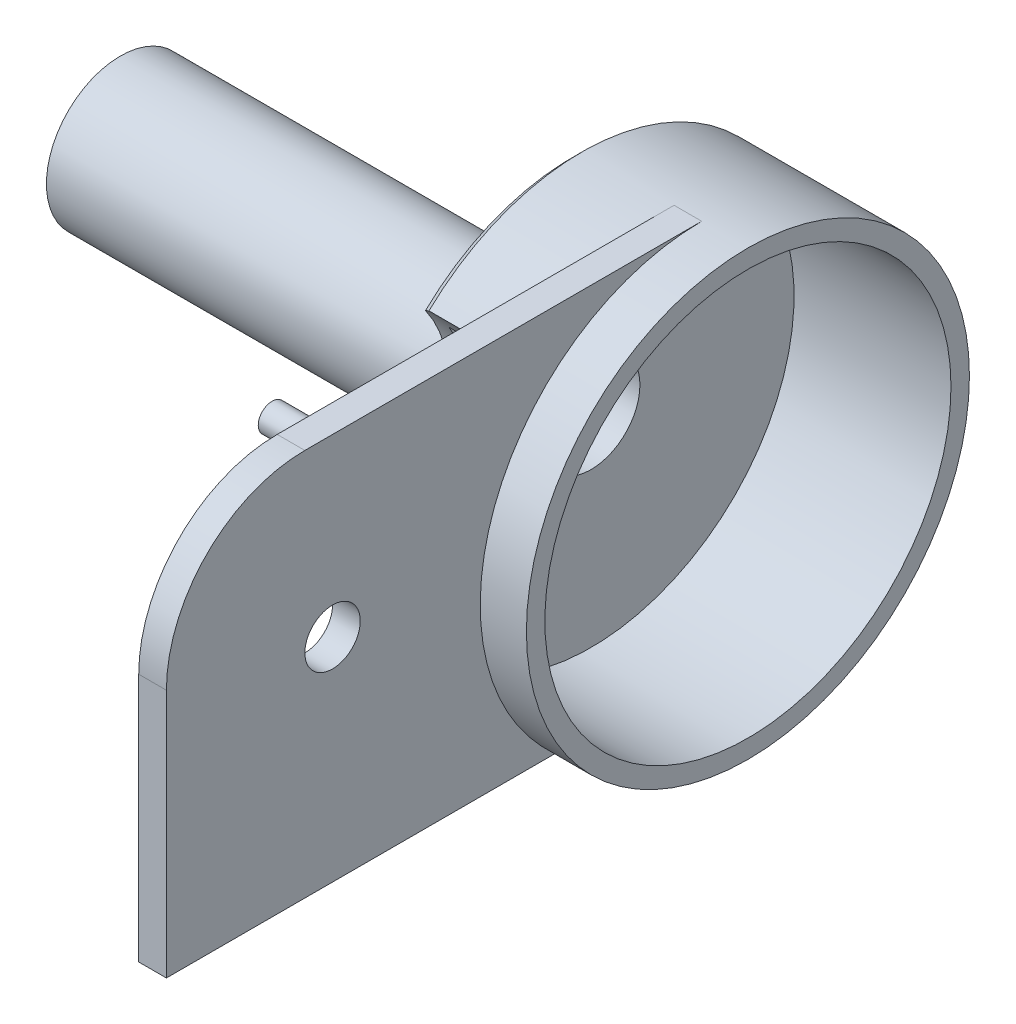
ISO-10303-21;
HEADER;
FILE_DESCRIPTION(('STEP AP214'),'2;1');
FILE_NAME('part.step','',(''),(''),'','','');
FILE_SCHEMA(('AUTOMOTIVE_DESIGN { 1 0 10303 214 1 1 1 1 }'));
ENDSEC;
DATA;
#1=APPLICATION_CONTEXT('core data for automotive mechanical design processes');
#2=APPLICATION_PROTOCOL_DEFINITION('international standard','automotive_design',2000,#1);
#3=PRODUCT_CONTEXT('',#1,'mechanical');
#4=PRODUCT('Part','Part','',(#3));
#5=PRODUCT_RELATED_PRODUCT_CATEGORY('part','',(#4));
#6=PRODUCT_DEFINITION_FORMATION('','',#4);
#7=PRODUCT_DEFINITION_CONTEXT('part definition',#1,'design');
#8=PRODUCT_DEFINITION('design','',#6,#7);
#9=PRODUCT_DEFINITION_SHAPE('','',#8);
#10=(LENGTH_UNIT() NAMED_UNIT(*) SI_UNIT(.MILLI.,.METRE.));
#11=(NAMED_UNIT(*) PLANE_ANGLE_UNIT() SI_UNIT($,.RADIAN.));
#12=(NAMED_UNIT(*) SI_UNIT($,.STERADIAN.) SOLID_ANGLE_UNIT());
#13=UNCERTAINTY_MEASURE_WITH_UNIT(LENGTH_MEASURE(1.E-05),#10,'distance_accuracy_value','');
#14=(GEOMETRIC_REPRESENTATION_CONTEXT(3) GLOBAL_UNCERTAINTY_ASSIGNED_CONTEXT((#13)) GLOBAL_UNIT_ASSIGNED_CONTEXT((#10,
#11,#12)) REPRESENTATION_CONTEXT('',''));
#15=CARTESIAN_POINT('',(0.,0.,0.));
#16=DIRECTION('',(0.,0.,1.));
#17=DIRECTION('',(1.,0.,0.));
#18=AXIS2_PLACEMENT_3D('',#15,#16,#17);
#19=CARTESIAN_POINT('',(0.,0.,0.));
#20=DIRECTION('',(1.,0.,0.));
#21=DIRECTION('',(0.,0.,-1.));
#22=AXIS2_PLACEMENT_3D('',#19,#20,#21);
#23=PLANE('',#22);
#24=CARTESIAN_POINT('',(0.,0.,-300.));
#25=DIRECTION('',(1.,0.,0.));
#26=DIRECTION('',(0.,0.,-1.));
#27=AXIS2_PLACEMENT_3D('',#24,#25,#26);
#28=CIRCLE('',#27,22.);
#29=CARTESIAN_POINT('',(0.,0.,-322.));
#30=VERTEX_POINT('',#29);
#31=EDGE_CURVE('E250',#30,#30,#28,.T.);
#32=ORIENTED_EDGE('',*,*,#31,.F.);
#33=EDGE_LOOP('',(#32));
#34=FACE_BOUND('',#33,.T.);
#35=CARTESIAN_POINT('',(0.,0.,-300.));
#36=DIRECTION('',(1.,0.,0.));
#37=DIRECTION('',(0.,0.,-1.));
#38=AXIS2_PLACEMENT_3D('',#35,#36,#37);
#39=CIRCLE('',#38,24.);
#40=CARTESIAN_POINT('',(0.,0.,-324.));
#41=VERTEX_POINT('',#40);
#42=EDGE_CURVE('E37',#41,#41,#39,.F.);
#43=ORIENTED_EDGE('',*,*,#42,.F.);
#44=EDGE_LOOP('',(#43));
#45=FACE_BOUND('',#44,.T.);
#46=ADVANCED_FACE('F33',(#34,#45),#23,.T.);
#47=CARTESIAN_POINT('',(-66.15,0.,-300.));
#48=DIRECTION('',(-1.,0.,0.));
#49=DIRECTION('',(0.,0.,-1.));
#50=AXIS2_PLACEMENT_3D('',#47,#48,#49);
#51=PLANE('',#50);
#52=CARTESIAN_POINT('',(-66.15,0.,-300.));
#53=DIRECTION('',(1.,0.,0.));
#54=DIRECTION('',(0.,0.,-1.));
#55=AXIS2_PLACEMENT_3D('',#52,#53,#54);
#56=CIRCLE('',#55,6.);
#57=CARTESIAN_POINT('',(-66.15,0.,-306.));
#58=VERTEX_POINT('',#57);
#59=EDGE_CURVE('E301',#58,#58,#56,.T.);
#60=ORIENTED_EDGE('',*,*,#59,.F.);
#61=EDGE_LOOP('',(#60));
#62=FACE_BOUND('',#61,.T.);
#63=CARTESIAN_POINT('',(-66.15,0.,-300.));
#64=DIRECTION('',(1.,0.,0.));
#65=DIRECTION('',(0.,0.,-1.));
#66=AXIS2_PLACEMENT_3D('',#63,#64,#65);
#67=CIRCLE('',#66,6.25);
#68=CARTESIAN_POINT('',(-66.15,0.,-306.25));
#69=VERTEX_POINT('',#68);
#70=EDGE_CURVE('E314',#69,#69,#67,.T.);
#71=ORIENTED_EDGE('',*,*,#70,.T.);
#72=EDGE_LOOP('',(#71));
#73=FACE_BOUND('',#72,.T.);
#74=ADVANCED_FACE('F152',(#62,#73),#51,.F.);
#75=CARTESIAN_POINT('',(-66.15,0.,-300.));
#76=DIRECTION('',(1.,0.,0.));
#77=DIRECTION('',(0.,0.,1.));
#78=AXIS2_PLACEMENT_3D('',#75,#76,#77);
#79=CYLINDRICAL_SURFACE('',#78,6.25);
#80=ORIENTED_EDGE('',*,*,#70,.F.);
#81=EDGE_LOOP('',(#80));
#82=FACE_BOUND('',#81,.T.);
#83=CARTESIAN_POINT('',(-65.,0.,-300.));
#84=DIRECTION('',(1.,0.,0.));
#85=DIRECTION('',(0.,0.,-1.));
#86=AXIS2_PLACEMENT_3D('',#83,#84,#85);
#87=CIRCLE('',#86,6.25);
#88=CARTESIAN_POINT('',(-65.,0.,-306.25));
#89=VERTEX_POINT('',#88);
#90=EDGE_CURVE('E310',#89,#89,#87,.T.);
#91=ORIENTED_EDGE('',*,*,#90,.T.);
#92=EDGE_LOOP('',(#91));
#93=FACE_BOUND('',#92,.T.);
#94=ADVANCED_FACE('F163',(#82,#93),#79,.F.);
#95=CARTESIAN_POINT('',(-61.,0.,-300.));
#96=DIRECTION('',(-1.,0.,0.));
#97=DIRECTION('',(0.,0.,-1.));
#98=AXIS2_PLACEMENT_3D('',#95,#96,#97);
#99=CYLINDRICAL_SURFACE('',#98,6.);
#100=ORIENTED_EDGE('',*,*,#59,.T.);
#101=EDGE_LOOP('',(#100));
#102=FACE_BOUND('',#101,.T.);
#103=CARTESIAN_POINT('',(-68.,0.,-300.));
#104=DIRECTION('',(1.,0.,0.));
#105=DIRECTION('',(0.,0.,-1.));
#106=AXIS2_PLACEMENT_3D('',#103,#104,#105);
#107=CIRCLE('',#106,5.99999999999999);
#108=CARTESIAN_POINT('',(-68.,0.,-306.));
#109=VERTEX_POINT('',#108);
#110=EDGE_CURVE('E299',#109,#109,#107,.T.);
#111=ORIENTED_EDGE('',*,*,#110,.F.);
#112=EDGE_LOOP('',(#111));
#113=FACE_BOUND('',#112,.T.);
#114=ADVANCED_FACE('F169',(#102,#113),#99,.F.);
#115=CARTESIAN_POINT('',(-65.,0.,-300.));
#116=DIRECTION('',(-1.,0.,0.));
#117=DIRECTION('',(0.,0.,-1.));
#118=AXIS2_PLACEMENT_3D('',#115,#116,#117);
#119=PLANE('',#118);
#120=CARTESIAN_POINT('',(-65.,0.,-300.));
#121=DIRECTION('',(1.,0.,0.));
#122=DIRECTION('',(0.,0.,-1.));
#123=AXIS2_PLACEMENT_3D('',#120,#121,#122);
#124=CIRCLE('',#123,6.);
#125=CARTESIAN_POINT('',(-65.,0.,-306.));
#126=VERTEX_POINT('',#125);
#127=EDGE_CURVE('E304',#126,#126,#124,.T.);
#128=ORIENTED_EDGE('',*,*,#127,.T.);
#129=EDGE_LOOP('',(#128));
#130=FACE_BOUND('',#129,.T.);
#131=ORIENTED_EDGE('',*,*,#90,.F.);
#132=EDGE_LOOP('',(#131));
#133=FACE_BOUND('',#132,.T.);
#134=ADVANCED_FACE('F176',(#130,#133),#119,.T.);
#135=CARTESIAN_POINT('',(-68.,0.,-300.));
#136=DIRECTION('',(-1.,0.,0.));
#137=DIRECTION('',(0.,0.,-1.));
#138=AXIS2_PLACEMENT_3D('',#135,#136,#137);
#139=PLANE('',#138);
#140=CARTESIAN_POINT('',(-68.,0.,-300.));
#141=DIRECTION('',(1.,0.,0.));
#142=DIRECTION('',(0.,0.,-1.));
#143=AXIS2_PLACEMENT_3D('',#140,#141,#142);
#144=CIRCLE('',#143,7.99999999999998);
#145=CARTESIAN_POINT('',(-68.,0.,-308.));
#146=VERTEX_POINT('',#145);
#147=EDGE_CURVE('E296',#146,#146,#144,.T.);
#148=ORIENTED_EDGE('',*,*,#147,.F.);
#149=EDGE_LOOP('',(#148));
#150=FACE_BOUND('',#149,.T.);
#151=ORIENTED_EDGE('',*,*,#110,.T.);
#152=EDGE_LOOP('',(#151));
#153=FACE_BOUND('',#152,.T.);
#154=ADVANCED_FACE('F284',(#150,#153),#139,.T.);
#155=CARTESIAN_POINT('',(-61.,0.,-300.));
#156=DIRECTION('',(-1.,0.,0.));
#157=DIRECTION('',(0.,0.,1.));
#158=AXIS2_PLACEMENT_3D('',#155,#156,#157);
#159=CIRCLE('',#158,6.);
#160=CARTESIAN_POINT('',(-61.,0.,-294.));
#161=VERTEX_POINT('',#160);
#162=EDGE_CURVE('E306',#161,#161,#159,.T.);
#163=ORIENTED_EDGE('',*,*,#162,.F.);
#164=EDGE_LOOP('',(#163));
#165=FACE_BOUND('',#164,.T.);
#166=ORIENTED_EDGE('',*,*,#127,.F.);
#167=EDGE_LOOP('',(#166));
#168=FACE_BOUND('',#167,.T.);
#169=ADVANCED_FACE('F217',(#165,#168),#99,.F.);
#170=CARTESIAN_POINT('',(3.62741699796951,0.,-300.));
#171=DIRECTION('',(-1.,0.,0.));
#172=DIRECTION('',(0.,0.,-1.));
#173=AXIS2_PLACEMENT_3D('',#170,#171,#172);
#174=CYLINDRICAL_SURFACE('',#173,7.99999999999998);
#175=CARTESIAN_POINT('',(-21.,0.,-300.));
#176=DIRECTION('',(-1.,0.,0.));
#177=DIRECTION('',(0.,0.,1.));
#178=AXIS2_PLACEMENT_3D('',#175,#176,#177);
#179=CIRCLE('',#178,7.99999999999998);
#180=CARTESIAN_POINT('',(-21.,0.,-292.));
#181=VERTEX_POINT('',#180);
#182=EDGE_CURVE('E252',#181,#181,#179,.T.);
#183=ORIENTED_EDGE('',*,*,#182,.T.);
#184=EDGE_LOOP('',(#183));
#185=FACE_BOUND('',#184,.T.);
#186=ORIENTED_EDGE('',*,*,#147,.T.);
#187=EDGE_LOOP('',(#186));
#188=FACE_BOUND('',#187,.T.);
#189=ADVANCED_FACE('F208',(#185,#188),#174,.T.);
#190=CARTESIAN_POINT('',(-25.,8.88991235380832,-273.448739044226));
#191=DIRECTION('',(-1.,0.,0.));
#192=DIRECTION('',(0.,0.,1.));
#193=AXIS2_PLACEMENT_3D('',#190,#191,#192);
#194=PLANE('',#193);
#195=CARTESIAN_POINT('',(-25.,8.88991235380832,-273.448739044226));
#196=DIRECTION('',(-1.,0.,0.));
#197=DIRECTION('',(0.,0.,1.));
#198=AXIS2_PLACEMENT_3D('',#195,#196,#197);
#199=CIRCLE('',#198,1.50000000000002);
#200=CARTESIAN_POINT('',(-25.,8.88991235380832,-271.948739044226));
#201=VERTEX_POINT('',#200);
#202=EDGE_CURVE('E222',#201,#201,#199,.T.);
#203=ORIENTED_EDGE('',*,*,#202,.T.);
#204=EDGE_LOOP('',(#203));
#205=FACE_BOUND('',#204,.T.);
#206=ADVANCED_FACE('F205',(#205),#194,.T.);
#207=CARTESIAN_POINT('',(-61.,0.,-300.));
#208=DIRECTION('',(1.,0.,0.));
#209=DIRECTION('',(0.,0.,1.));
#210=AXIS2_PLACEMENT_3D('',#207,#208,#209);
#211=PLANE('',#210);
#212=CARTESIAN_POINT('',(-61.,0.,-300.));
#213=DIRECTION('',(-1.,0.,0.));
#214=DIRECTION('',(0.,0.,1.));
#215=AXIS2_PLACEMENT_3D('',#212,#213,#214);
#216=CIRCLE('',#215,5.30000000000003);
#217=CARTESIAN_POINT('',(-61.,0.,-294.7));
#218=VERTEX_POINT('',#217);
#219=EDGE_CURVE('E319',#218,#218,#216,.T.);
#220=ORIENTED_EDGE('',*,*,#219,.F.);
#221=EDGE_LOOP('',(#220));
#222=FACE_BOUND('',#221,.T.);
#223=ORIENTED_EDGE('',*,*,#162,.T.);
#224=EDGE_LOOP('',(#223));
#225=FACE_BOUND('',#224,.T.);
#226=ADVANCED_FACE('F207',(#222,#225),#211,.F.);
#227=CARTESIAN_POINT('',(-21.,0.,-300.));
#228=DIRECTION('',(-1.,0.,0.));
#229=DIRECTION('',(0.,0.,1.));
#230=AXIS2_PLACEMENT_3D('',#227,#228,#229);
#231=TOROIDAL_SURFACE('',#230,9.99999999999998,2.);
#232=ORIENTED_EDGE('',*,*,#182,.F.);
#233=EDGE_LOOP('',(#232));
#234=FACE_BOUND('',#233,.T.);
#235=CARTESIAN_POINT('',(-19.,0.,-300.));
#236=DIRECTION('',(-1.,0.,0.));
#237=DIRECTION('',(0.,0.,1.));
#238=AXIS2_PLACEMENT_3D('',#235,#236,#237);
#239=CIRCLE('',#238,9.99999999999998);
#240=CARTESIAN_POINT('',(-19.,0.,-290.));
#241=VERTEX_POINT('',#240);
#242=EDGE_CURVE('E119',#241,#241,#239,.F.);
#243=ORIENTED_EDGE('',*,*,#242,.F.);
#244=EDGE_LOOP('',(#243));
#245=FACE_BOUND('',#244,.T.);
#246=ADVANCED_FACE('F214',(#234,#245),#231,.F.);
#247=CARTESIAN_POINT('',(-8.,9.00000000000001,-257.));
#248=DIRECTION('',(1.,0.,0.));
#249=DIRECTION('',(0.,0.,-1.));
#250=AXIS2_PLACEMENT_3D('',#247,#248,#249);
#251=CYLINDRICAL_SURFACE('',#250,15.);
#252=CARTESIAN_POINT('',(-8.,9.00000000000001,-257.));
#253=DIRECTION('',(-1.,0.,0.));
#254=DIRECTION('',(0.,0.,1.));
#255=AXIS2_PLACEMENT_3D('',#252,#253,#254);
#256=CIRCLE('',#255,15.);
#257=CARTESIAN_POINT('',(-8.,9.00000000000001,-242.));
#258=VERTEX_POINT('',#257);
#259=CARTESIAN_POINT('',(-8.,24.,-257.));
#260=VERTEX_POINT('',#259);
#261=EDGE_CURVE('E358',#258,#260,#256,.T.);
#262=ORIENTED_EDGE('',*,*,#261,.F.);
#263=DIRECTION('',(1.,0.,0.));
#264=VECTOR('',#263,1.);
#265=CARTESIAN_POINT('',(-8.,9.00000000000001,-242.));
#266=LINE('',#265,#264);
#267=CARTESIAN_POINT('',(-5.,9.00000000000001,-242.));
#268=VERTEX_POINT('',#267);
#269=EDGE_CURVE('E357',#268,#258,#266,.F.);
#270=ORIENTED_EDGE('',*,*,#269,.F.);
#271=CARTESIAN_POINT('',(-5.,9.00000000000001,-257.));
#272=DIRECTION('',(-1.,0.,0.));
#273=DIRECTION('',(0.,0.,1.));
#274=AXIS2_PLACEMENT_3D('',#271,#272,#273);
#275=CIRCLE('',#274,15.);
#276=CARTESIAN_POINT('',(-5.,24.,-257.));
#277=VERTEX_POINT('',#276);
#278=EDGE_CURVE('E364',#277,#268,#275,.F.);
#279=ORIENTED_EDGE('',*,*,#278,.F.);
#280=DIRECTION('',(1.,0.,0.));
#281=VECTOR('',#280,1.);
#282=CARTESIAN_POINT('',(-8.,24.,-257.));
#283=LINE('',#282,#281);
#284=EDGE_CURVE('E362',#260,#277,#283,.T.);
#285=ORIENTED_EDGE('',*,*,#284,.F.);
#286=EDGE_LOOP('',(#262,#270,#279,#285));
#287=FACE_BOUND('',#286,.T.);
#288=ADVANCED_FACE('F190',(#287),#251,.T.);
#289=CARTESIAN_POINT('',(-8.,24.,-242.));
#290=DIRECTION('',(0.,0.,-1.));
#291=DIRECTION('',(-1.,0.,0.));
#292=AXIS2_PLACEMENT_3D('',#289,#290,#291);
#293=PLANE('',#292);
#294=DIRECTION('',(0.,1.,0.));
#295=VECTOR('',#294,1.);
#296=CARTESIAN_POINT('',(-5.,24.,-242.));
#297=LINE('',#296,#295);
#298=CARTESIAN_POINT('',(-5.,-18.,-242.));
#299=VERTEX_POINT('',#298);
#300=EDGE_CURVE('E334',#299,#268,#297,.T.);
#301=ORIENTED_EDGE('',*,*,#300,.T.);
#302=ORIENTED_EDGE('',*,*,#269,.T.);
#303=DIRECTION('',(0.,1.,0.));
#304=VECTOR('',#303,1.);
#305=CARTESIAN_POINT('',(-8.,24.,-242.));
#306=LINE('',#305,#304);
#307=CARTESIAN_POINT('',(-8.,-18.,-242.));
#308=VERTEX_POINT('',#307);
#309=EDGE_CURVE('E340',#308,#258,#306,.T.);
#310=ORIENTED_EDGE('',*,*,#309,.F.);
#311=DIRECTION('',(1.,0.,0.));
#312=VECTOR('',#311,1.);
#313=CARTESIAN_POINT('',(-8.,-18.,-242.));
#314=LINE('',#313,#312);
#315=EDGE_CURVE('E325',#308,#299,#314,.T.);
#316=ORIENTED_EDGE('',*,*,#315,.T.);
#317=EDGE_LOOP('',(#301,#302,#310,#316));
#318=FACE_BOUND('',#317,.T.);
#319=ADVANCED_FACE('F186',(#318),#293,.F.);
#320=CARTESIAN_POINT('',(-3.75735931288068,8.88991235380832,-273.448739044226));
#321=DIRECTION('',(-1.,0.,0.));
#322=DIRECTION('',(0.,0.,1.));
#323=AXIS2_PLACEMENT_3D('',#320,#321,#322);
#324=CYLINDRICAL_SURFACE('',#323,1.50000000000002);
#325=CARTESIAN_POINT('',(-8.,8.88991235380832,-273.448739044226));
#326=DIRECTION('',(-1.,0.,0.));
#327=DIRECTION('',(0.,0.,1.));
#328=AXIS2_PLACEMENT_3D('',#325,#326,#327);
#329=CIRCLE('',#328,1.50000000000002);
#330=CARTESIAN_POINT('',(-8.,8.88991235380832,-271.948739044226));
#331=VERTEX_POINT('',#330);
#332=EDGE_CURVE('E368',#331,#331,#329,.T.);
#333=ORIENTED_EDGE('',*,*,#332,.T.);
#334=EDGE_LOOP('',(#333));
#335=FACE_BOUND('',#334,.T.);
#336=ORIENTED_EDGE('',*,*,#202,.F.);
#337=EDGE_LOOP('',(#336));
#338=FACE_BOUND('',#337,.T.);
#339=ADVANCED_FACE('F189',(#335,#338),#324,.T.);
#340=CARTESIAN_POINT('',(90.,5.,-260.));
#341=DIRECTION('',(-1.,0.,0.));
#342=DIRECTION('',(0.,0.,1.));
#343=AXIS2_PLACEMENT_3D('',#340,#341,#342);
#344=CYLINDRICAL_SURFACE('',#343,2.99999999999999);
#345=CARTESIAN_POINT('',(-8.,5.,-260.));
#346=DIRECTION('',(-1.,0.,0.));
#347=DIRECTION('',(0.,0.,1.));
#348=AXIS2_PLACEMENT_3D('',#345,#346,#347);
#349=CIRCLE('',#348,2.99999999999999);
#350=CARTESIAN_POINT('',(-8.,5.,-257.));
#351=VERTEX_POINT('',#350);
#352=EDGE_CURVE('E228',#351,#351,#349,.T.);
#353=ORIENTED_EDGE('',*,*,#352,.T.);
#354=EDGE_LOOP('',(#353));
#355=FACE_BOUND('',#354,.T.);
#356=CARTESIAN_POINT('',(-5.,5.,-260.));
#357=DIRECTION('',(-1.,0.,0.));
#358=DIRECTION('',(0.,0.,1.));
#359=AXIS2_PLACEMENT_3D('',#356,#357,#358);
#360=CIRCLE('',#359,2.99999999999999);
#361=CARTESIAN_POINT('',(-5.,5.,-257.));
#362=VERTEX_POINT('',#361);
#363=EDGE_CURVE('E224',#362,#362,#360,.T.);
#364=ORIENTED_EDGE('',*,*,#363,.F.);
#365=EDGE_LOOP('',(#364));
#366=FACE_BOUND('',#365,.T.);
#367=ADVANCED_FACE('F148',(#355,#366),#344,.F.);
#368=CARTESIAN_POINT('',(90.,0.,-300.));
#369=DIRECTION('',(-1.,0.,0.));
#370=DIRECTION('',(0.,0.,-1.));
#371=AXIS2_PLACEMENT_3D('',#368,#369,#370);
#372=CYLINDRICAL_SURFACE('',#371,5.30000000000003);
#373=ORIENTED_EDGE('',*,*,#219,.T.);
#374=EDGE_LOOP('',(#373));
#375=FACE_BOUND('',#374,.T.);
#376=CARTESIAN_POINT('',(-17.,0.,-300.));
#377=DIRECTION('',(1.,0.,0.));
#378=DIRECTION('',(0.,0.,-1.));
#379=AXIS2_PLACEMENT_3D('',#376,#377,#378);
#380=CIRCLE('',#379,5.30000000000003);
#381=CARTESIAN_POINT('',(-17.,0.,-305.3));
#382=VERTEX_POINT('',#381);
#383=EDGE_CURVE('E313',#382,#382,#380,.T.);
#384=ORIENTED_EDGE('',*,*,#383,.T.);
#385=EDGE_LOOP('',(#384));
#386=FACE_BOUND('',#385,.T.);
#387=ADVANCED_FACE('F177',(#375,#386),#372,.F.);
#388=CARTESIAN_POINT('',(-19.,0.,-300.));
#389=DIRECTION('',(-1.,0.,0.));
#390=DIRECTION('',(0.,0.,-1.));
#391=AXIS2_PLACEMENT_3D('',#388,#389,#390);
#392=PLANE('',#391);
#393=ORIENTED_EDGE('',*,*,#242,.T.);
#394=EDGE_LOOP('',(#393));
#395=FACE_BOUND('',#394,.T.);
#396=CARTESIAN_POINT('',(-19.,8.88991235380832,-273.448739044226));
#397=DIRECTION('',(-1.,0.,0.));
#398=DIRECTION('',(0.,0.,1.));
#399=AXIS2_PLACEMENT_3D('',#396,#397,#398);
#400=CIRCLE('',#399,13.1100876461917);
#401=CARTESIAN_POINT('',(-19.,16.5840410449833,-284.063576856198));
#402=VERTEX_POINT('',#401);
#403=CARTESIAN_POINT('',(-19.,-3.64461937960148,-277.290602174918));
#404=VERTEX_POINT('',#403);
#405=EDGE_CURVE('E11',#402,#404,#400,.T.);
#406=ORIENTED_EDGE('',*,*,#405,.F.);
#407=CARTESIAN_POINT('',(-19.,0.,-300.));
#408=DIRECTION('',(-1.,0.,0.));
#409=DIRECTION('',(0.,0.,1.));
#410=AXIS2_PLACEMENT_3D('',#407,#408,#409);
#411=CIRCLE('',#410,23.);
#412=EDGE_CURVE('E114',#402,#404,#411,.T.);
#413=ORIENTED_EDGE('',*,*,#412,.T.);
#414=EDGE_LOOP('',(#406,#413));
#415=FACE_BOUND('',#414,.T.);
#416=ADVANCED_FACE('F115',(#395,#415),#392,.T.);
#417=CARTESIAN_POINT('',(-8.,-18.,-242.));
#418=DIRECTION('',(0.,1.,0.));
#419=DIRECTION('',(0.,0.,1.));
#420=AXIS2_PLACEMENT_3D('',#417,#418,#419);
#421=PLANE('',#420);
#422=DIRECTION('',(0.,0.,1.));
#423=VECTOR('',#422,1.);
#424=CARTESIAN_POINT('',(-5.,-18.,-242.));
#425=LINE('',#424,#423);
#426=CARTESIAN_POINT('',(-5.,-18.,-284.125492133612));
#427=VERTEX_POINT('',#426);
#428=EDGE_CURVE('E231',#427,#299,#425,.T.);
#429=ORIENTED_EDGE('',*,*,#428,.T.);
#430=ORIENTED_EDGE('',*,*,#315,.F.);
#431=DIRECTION('',(0.,0.,1.));
#432=VECTOR('',#431,1.);
#433=CARTESIAN_POINT('',(-8.,-18.,-242.));
#434=LINE('',#433,#432);
#435=CARTESIAN_POINT('',(-8.,-18.,-284.125492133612));
#436=VERTEX_POINT('',#435);
#437=EDGE_CURVE('E342',#436,#308,#434,.T.);
#438=ORIENTED_EDGE('',*,*,#437,.F.);
#439=DIRECTION('',(1.,0.,0.));
#440=VECTOR('',#439,1.);
#441=CARTESIAN_POINT('',(-8.,-18.,-284.125492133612));
#442=LINE('',#441,#440);
#443=EDGE_CURVE('E323',#436,#427,#442,.T.);
#444=ORIENTED_EDGE('',*,*,#443,.T.);
#445=EDGE_LOOP('',(#429,#430,#438,#444));
#446=FACE_BOUND('',#445,.T.);
#447=ADVANCED_FACE('F181',(#446),#421,.F.);
#448=CARTESIAN_POINT('',(-5.,0.,-300.));
#449=DIRECTION('',(-1.,0.,0.));
#450=DIRECTION('',(0.,0.,1.));
#451=AXIS2_PLACEMENT_3D('',#448,#449,#450);
#452=PLANE('',#451);
#453=ORIENTED_EDGE('',*,*,#363,.T.);
#454=EDGE_LOOP('',(#453));
#455=FACE_BOUND('',#454,.T.);
#456=DIRECTION('',(0.,0.,-1.));
#457=VECTOR('',#456,1.);
#458=CARTESIAN_POINT('',(-5.,24.,-300.));
#459=LINE('',#458,#457);
#460=CARTESIAN_POINT('',(-5.,24.,-300.));
#461=VERTEX_POINT('',#460);
#462=EDGE_CURVE('E332',#277,#461,#459,.T.);
#463=ORIENTED_EDGE('',*,*,#462,.F.);
#464=ORIENTED_EDGE('',*,*,#278,.T.);
#465=ORIENTED_EDGE('',*,*,#300,.F.);
#466=ORIENTED_EDGE('',*,*,#428,.F.);
#467=CARTESIAN_POINT('',(-5.,0.,-300.));
#468=DIRECTION('',(1.,0.,0.));
#469=DIRECTION('',(0.,0.,1.));
#470=AXIS2_PLACEMENT_3D('',#467,#468,#469);
#471=CIRCLE('',#470,24.);
#472=EDGE_CURVE('E225',#461,#427,#471,.T.);
#473=ORIENTED_EDGE('',*,*,#472,.F.);
#474=EDGE_LOOP('',(#463,#464,#465,#466,#473));
#475=FACE_BOUND('',#474,.T.);
#476=ADVANCED_FACE('F184',(#455,#475),#452,.F.);
#477=CARTESIAN_POINT('',(-8.,24.,-300.));
#478=DIRECTION('',(0.,-1.,0.));
#479=DIRECTION('',(0.,0.,-1.));
#480=AXIS2_PLACEMENT_3D('',#477,#478,#479);
#481=PLANE('',#480);
#482=DIRECTION('',(0.,0.,-1.));
#483=VECTOR('',#482,1.);
#484=CARTESIAN_POINT('',(-8.,24.,-300.));
#485=LINE('',#484,#483);
#486=CARTESIAN_POINT('',(-8.,24.,-300.));
#487=VERTEX_POINT('',#486);
#488=EDGE_CURVE('E331',#260,#487,#485,.T.);
#489=ORIENTED_EDGE('',*,*,#488,.F.);
#490=ORIENTED_EDGE('',*,*,#284,.T.);
#491=ORIENTED_EDGE('',*,*,#462,.T.);
#492=DIRECTION('',(1.,0.,0.));
#493=VECTOR('',#492,1.);
#494=CARTESIAN_POINT('',(-8.,24.,-300.));
#495=LINE('',#494,#493);
#496=EDGE_CURVE('E328',#487,#461,#495,.T.);
#497=ORIENTED_EDGE('',*,*,#496,.F.);
#498=EDGE_LOOP('',(#489,#490,#491,#497));
#499=FACE_BOUND('',#498,.T.);
#500=ADVANCED_FACE('F192',(#499),#481,.F.);
#501=CARTESIAN_POINT('',(-18.,0.,-300.));
#502=DIRECTION('',(1.,0.,0.));
#503=DIRECTION('',(0.,0.,-1.));
#504=AXIS2_PLACEMENT_3D('',#501,#502,#503);
#505=CONICAL_SURFACE('',#504,24.,0.785398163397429);
#506=CARTESIAN_POINT('',(-19.,-3.64461937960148,-277.290602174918));
#507=CARTESIAN_POINT('',(-18.8336648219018,-3.6938134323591,-277.130049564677));
#508=CARTESIAN_POINT('',(-18.6671638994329,-3.73986234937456,-276.968834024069));
#509=CARTESIAN_POINT('',(-18.3338305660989,-3.82566991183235,-276.645077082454));
#510=CARTESIAN_POINT('',(-18.1669981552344,-3.86542855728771,-276.482535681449));
#511=CARTESIAN_POINT('',(-18.,-3.90204206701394,-276.319331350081));
#512=B_SPLINE_CURVE_WITH_KNOTS('',3,(#506,#507,#508,#509,#510,#511),.UNSPECIFIED.,.F.,.F.,(4,2,
4),(0.,0.708873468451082,1.41774693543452),.UNSPECIFIED.);
#513=CARTESIAN_POINT('',(-18.,-3.90204206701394,-276.319331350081));
#514=VERTEX_POINT('',#513);
#515=EDGE_CURVE('E122',#404,#514,#512,.T.);
#516=ORIENTED_EDGE('',*,*,#515,.F.);
#517=ORIENTED_EDGE('',*,*,#412,.F.);
#518=CARTESIAN_POINT('',(-18.,17.3744049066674,-283.44312667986));
#519=CARTESIAN_POINT('',(-18.1669981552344,17.2469013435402,-283.551381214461));
#520=CARTESIAN_POINT('',(-18.3338305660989,17.1172859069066,-283.657212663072));
#521=CARTESIAN_POINT('',(-18.6671638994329,16.853831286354,-283.864029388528));
#522=CARTESIAN_POINT('',(-18.8336648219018,16.7199921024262,-283.965014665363));
#523=CARTESIAN_POINT('',(-19.,16.5840410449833,-284.063576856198));
#524=B_SPLINE_CURVE_WITH_KNOTS('',3,(#518,#519,#520,#521,#522,#523),.UNSPECIFIED.,.F.,.F.,(4,2,
4),(0.,0.708873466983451,1.41774693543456),.UNSPECIFIED.);
#525=CARTESIAN_POINT('',(-18.,17.3744049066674,-283.44312667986));
#526=VERTEX_POINT('',#525);
#527=EDGE_CURVE('E118',#526,#402,#524,.T.);
#528=ORIENTED_EDGE('',*,*,#527,.F.);
#529=CARTESIAN_POINT('',(-18.,0.,-300.));
#530=DIRECTION('',(-1.,0.,0.));
#531=DIRECTION('',(0.,0.,1.));
#532=AXIS2_PLACEMENT_3D('',#529,#530,#531);
#533=CIRCLE('',#532,24.);
#534=EDGE_CURVE('E127',#514,#526,#533,.F.);
#535=ORIENTED_EDGE('',*,*,#534,.F.);
#536=EDGE_LOOP('',(#516,#517,#528,#535));
#537=FACE_BOUND('',#536,.T.);
#538=ADVANCED_FACE('F125',(#537),#505,.T.);
#539=CARTESIAN_POINT('',(-8.,0.,-300.));
#540=DIRECTION('',(-1.,0.,0.));
#541=DIRECTION('',(0.,0.,1.));
#542=AXIS2_PLACEMENT_3D('',#539,#540,#541);
#543=PLANE('',#542);
#544=ORIENTED_EDGE('',*,*,#352,.F.);
#545=EDGE_LOOP('',(#544));
#546=FACE_BOUND('',#545,.T.);
#547=ORIENTED_EDGE('',*,*,#332,.F.);
#548=EDGE_LOOP('',(#547));
#549=FACE_BOUND('',#548,.T.);
#550=ORIENTED_EDGE('',*,*,#309,.T.);
#551=ORIENTED_EDGE('',*,*,#261,.T.);
#552=ORIENTED_EDGE('',*,*,#488,.T.);
#553=CARTESIAN_POINT('',(-8.,0.,-300.));
#554=DIRECTION('',(1.,0.,0.));
#555=DIRECTION('',(0.,0.,1.));
#556=AXIS2_PLACEMENT_3D('',#553,#554,#555);
#557=CIRCLE('',#556,24.);
#558=CARTESIAN_POINT('',(-8.,17.3744049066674,-283.44312667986));
#559=VERTEX_POINT('',#558);
#560=EDGE_CURVE('E235',#487,#559,#557,.T.);
#561=ORIENTED_EDGE('',*,*,#560,.T.);
#562=CARTESIAN_POINT('',(-8.,8.88991235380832,-273.448739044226));
#563=DIRECTION('',(-1.,0.,0.));
#564=DIRECTION('',(0.,0.,1.));
#565=AXIS2_PLACEMENT_3D('',#562,#563,#564);
#566=CIRCLE('',#565,13.1100876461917);
#567=CARTESIAN_POINT('',(-8.,15.7383979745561,-284.627855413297));
#568=VERTEX_POINT('',#567);
#569=EDGE_CURVE('E50',#568,#559,#566,.F.);
#570=ORIENTED_EDGE('',*,*,#569,.F.);
#571=CARTESIAN_POINT('',(-8.,0.,-300.));
#572=DIRECTION('',(-1.,0.,0.));
#573=DIRECTION('',(0.,0.,1.));
#574=AXIS2_PLACEMENT_3D('',#571,#572,#573);
#575=CIRCLE('',#574,22.);
#576=CARTESIAN_POINT('',(-8.,-3.30923913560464,-278.250311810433));
#577=VERTEX_POINT('',#576);
#578=EDGE_CURVE('E57',#577,#568,#575,.T.);
#579=ORIENTED_EDGE('',*,*,#578,.F.);
#580=CARTESIAN_POINT('',(-8.,-3.90204206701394,-276.319331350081));
#581=VERTEX_POINT('',#580);
#582=EDGE_CURVE('E246',#581,#577,#566,.F.);
#583=ORIENTED_EDGE('',*,*,#582,.F.);
#584=EDGE_CURVE('E335',#581,#436,#557,.T.);
#585=ORIENTED_EDGE('',*,*,#584,.T.);
#586=ORIENTED_EDGE('',*,*,#437,.T.);
#587=EDGE_LOOP('',(#550,#551,#552,#561,#570,#579,#583,#585,#586));
#588=FACE_BOUND('',#587,.T.);
#589=ADVANCED_FACE('F199',(#546,#549,#588),#543,.T.);
#590=CARTESIAN_POINT('',(-17.,0.,-300.));
#591=DIRECTION('',(-1.,0.,0.));
#592=DIRECTION('',(0.,0.,-1.));
#593=AXIS2_PLACEMENT_3D('',#590,#591,#592);
#594=PLANE('',#593);
#595=CARTESIAN_POINT('',(-17.,0.,-300.));
#596=DIRECTION('',(-1.,0.,0.));
#597=DIRECTION('',(0.,0.,1.));
#598=AXIS2_PLACEMENT_3D('',#595,#596,#597);
#599=CIRCLE('',#598,22.);
#600=CARTESIAN_POINT('',(-17.,-3.30923913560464,-278.250311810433));
#601=VERTEX_POINT('',#600);
#602=CARTESIAN_POINT('',(-17.,15.7383979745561,-284.627855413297));
#603=VERTEX_POINT('',#602);
#604=EDGE_CURVE('E320',#601,#603,#599,.F.);
#605=ORIENTED_EDGE('',*,*,#604,.T.);
#606=CARTESIAN_POINT('',(-17.,8.88991235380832,-273.448739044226));
#607=DIRECTION('',(-1.,0.,0.));
#608=DIRECTION('',(0.,0.,1.));
#609=AXIS2_PLACEMENT_3D('',#606,#607,#608);
#610=CIRCLE('',#609,13.1100876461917);
#611=EDGE_CURVE('E241',#603,#601,#610,.T.);
#612=ORIENTED_EDGE('',*,*,#611,.T.);
#613=EDGE_LOOP('',(#605,#612));
#614=FACE_BOUND('',#613,.T.);
#615=ORIENTED_EDGE('',*,*,#383,.F.);
#616=EDGE_LOOP('',(#615));
#617=FACE_BOUND('',#616,.T.);
#618=ADVANCED_FACE('F147',(#614,#617),#594,.F.);
#619=CARTESIAN_POINT('',(15.7523897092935,8.88991235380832,-273.448739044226));
#620=DIRECTION('',(-1.,0.,0.));
#621=DIRECTION('',(0.,0.,1.));
#622=AXIS2_PLACEMENT_3D('',#619,#620,#621);
#623=CYLINDRICAL_SURFACE('',#622,13.1100876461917);
#624=DIRECTION('',(-1.,0.,0.));
#625=VECTOR('',#624,1.);
#626=CARTESIAN_POINT('',(15.7523897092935,17.3744049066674,-283.44312667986));
#627=LINE('',#626,#625);
#628=EDGE_CURVE('E248',#559,#526,#627,.T.);
#629=ORIENTED_EDGE('',*,*,#628,.T.);
#630=ORIENTED_EDGE('',*,*,#527,.T.);
#631=ORIENTED_EDGE('',*,*,#405,.T.);
#632=ORIENTED_EDGE('',*,*,#515,.T.);
#633=DIRECTION('',(-1.,0.,0.));
#634=VECTOR('',#633,1.);
#635=CARTESIAN_POINT('',(15.7523897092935,-3.90204206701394,-276.319331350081));
#636=LINE('',#635,#634);
#637=EDGE_CURVE('E42',#581,#514,#636,.T.);
#638=ORIENTED_EDGE('',*,*,#637,.F.);
#639=ORIENTED_EDGE('',*,*,#582,.T.);
#640=DIRECTION('',(-1.,0.,0.));
#641=VECTOR('',#640,1.);
#642=CARTESIAN_POINT('',(-13.5,-3.30923913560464,-278.250311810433));
#643=LINE('',#642,#641);
#644=EDGE_CURVE('E244',#577,#601,#643,.T.);
#645=ORIENTED_EDGE('',*,*,#644,.T.);
#646=ORIENTED_EDGE('',*,*,#611,.F.);
#647=DIRECTION('',(-1.,0.,0.));
#648=VECTOR('',#647,1.);
#649=CARTESIAN_POINT('',(-13.5,15.7383979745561,-284.627855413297));
#650=LINE('',#649,#648);
#651=EDGE_CURVE('E239',#603,#568,#650,.F.);
#652=ORIENTED_EDGE('',*,*,#651,.T.);
#653=ORIENTED_EDGE('',*,*,#569,.T.);
#654=EDGE_LOOP('',(#629,#630,#631,#632,#638,#639,#645,#646,#652,#653));
#655=FACE_BOUND('',#654,.T.);
#656=ADVANCED_FACE('F121',(#655),#623,.F.);
#657=CARTESIAN_POINT('',(19.,0.,-300.));
#658=DIRECTION('',(-1.,0.,0.));
#659=DIRECTION('',(0.,0.,1.));
#660=AXIS2_PLACEMENT_3D('',#657,#658,#659);
#661=CYLINDRICAL_SURFACE('',#660,22.);
#662=ORIENTED_EDGE('',*,*,#651,.F.);
#663=ORIENTED_EDGE('',*,*,#604,.F.);
#664=ORIENTED_EDGE('',*,*,#644,.F.);
#665=ORIENTED_EDGE('',*,*,#578,.T.);
#666=EDGE_LOOP('',(#662,#663,#664,#665));
#667=FACE_BOUND('',#666,.T.);
#668=ORIENTED_EDGE('',*,*,#31,.T.);
#669=EDGE_LOOP('',(#668));
#670=FACE_BOUND('',#669,.T.);
#671=ADVANCED_FACE('F35',(#667,#670),#661,.F.);
#672=CARTESIAN_POINT('',(-17.,0.,-300.));
#673=DIRECTION('',(-1.,0.,0.));
#674=DIRECTION('',(0.,0.,-1.));
#675=AXIS2_PLACEMENT_3D('',#672,#673,#674);
#676=CYLINDRICAL_SURFACE('',#675,24.);
#677=ORIENTED_EDGE('',*,*,#637,.T.);
#678=ORIENTED_EDGE('',*,*,#534,.T.);
#679=ORIENTED_EDGE('',*,*,#628,.F.);
#680=ORIENTED_EDGE('',*,*,#560,.F.);
#681=ORIENTED_EDGE('',*,*,#496,.T.);
#682=ORIENTED_EDGE('',*,*,#472,.T.);
#683=ORIENTED_EDGE('',*,*,#443,.F.);
#684=ORIENTED_EDGE('',*,*,#584,.F.);
#685=EDGE_LOOP('',(#677,#678,#679,#680,#681,#682,#683,#684));
#686=FACE_BOUND('',#685,.T.);
#687=ORIENTED_EDGE('',*,*,#42,.T.);
#688=EDGE_LOOP('',(#687));
#689=FACE_BOUND('',#688,.T.);
#690=ADVANCED_FACE('F154',(#686,#689),#676,.T.);
#691=CLOSED_SHELL('',(#46,#74,#94,#114,#134,#154,#169,#189,#206,#226,#246,#288,#319,#339,#367,
#387,#416,#447,#476,#500,#538,#589,#618,#656,#671,#690));
#692=MANIFOLD_SOLID_BREP('B2',#691);
#693=ADVANCED_BREP_SHAPE_REPRESENTATION('',(#18,#692),#14);
#694=SHAPE_DEFINITION_REPRESENTATION(#9,#693);
ENDSEC;
END-ISO-10303-21;
